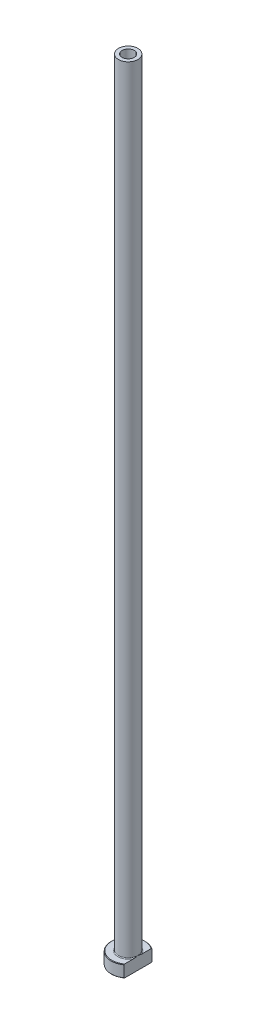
ISO-10303-21;
HEADER;
FILE_DESCRIPTION(('STEP AP214'),'2;1');
FILE_NAME('part.step','',(''),(''),'','','');
FILE_SCHEMA(('AUTOMOTIVE_DESIGN { 1 0 10303 214 1 1 1 1 }'));
ENDSEC;
DATA;
#1=APPLICATION_CONTEXT('core data for automotive mechanical design processes');
#2=APPLICATION_PROTOCOL_DEFINITION('international standard','automotive_design',2000,#1);
#3=PRODUCT_CONTEXT('',#1,'mechanical');
#4=PRODUCT('Part','Part','',(#3));
#5=PRODUCT_RELATED_PRODUCT_CATEGORY('part','',(#4));
#6=PRODUCT_DEFINITION_FORMATION('','',#4);
#7=PRODUCT_DEFINITION_CONTEXT('part definition',#1,'design');
#8=PRODUCT_DEFINITION('design','',#6,#7);
#9=PRODUCT_DEFINITION_SHAPE('','',#8);
#10=(LENGTH_UNIT() NAMED_UNIT(*) SI_UNIT(.MILLI.,.METRE.));
#11=(NAMED_UNIT(*) PLANE_ANGLE_UNIT() SI_UNIT($,.RADIAN.));
#12=(NAMED_UNIT(*) SI_UNIT($,.STERADIAN.) SOLID_ANGLE_UNIT());
#13=UNCERTAINTY_MEASURE_WITH_UNIT(LENGTH_MEASURE(1.E-05),#10,'distance_accuracy_value','');
#14=(GEOMETRIC_REPRESENTATION_CONTEXT(3) GLOBAL_UNCERTAINTY_ASSIGNED_CONTEXT((#13)) GLOBAL_UNIT_ASSIGNED_CONTEXT((#10,
#11,#12)) REPRESENTATION_CONTEXT('',''));
#15=CARTESIAN_POINT('',(0.,0.,0.));
#16=DIRECTION('',(0.,0.,1.));
#17=DIRECTION('',(1.,0.,0.));
#18=AXIS2_PLACEMENT_3D('',#15,#16,#17);
#19=CARTESIAN_POINT('',(0.,92.1876809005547,0.));
#20=DIRECTION('',(0.,1.,0.));
#21=DIRECTION('',(0.,0.,1.));
#22=AXIS2_PLACEMENT_3D('',#19,#20,#21);
#23=CYLINDRICAL_SURFACE('',#22,2.50000000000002);
#24=CARTESIAN_POINT('',(0.,325.,0.));
#25=DIRECTION('',(0.,1.,0.));
#26=DIRECTION('',(0.,0.,1.));
#27=AXIS2_PLACEMENT_3D('',#24,#25,#26);
#28=CIRCLE('',#27,2.50000000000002);
#29=CARTESIAN_POINT('',(0.,325.,2.50000000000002));
#30=VERTEX_POINT('',#29);
#31=EDGE_CURVE('E167',#30,#30,#28,.T.);
#32=ORIENTED_EDGE('',*,*,#31,.T.);
#33=EDGE_LOOP('',(#32));
#34=FACE_BOUND('',#33,.T.);
#35=CARTESIAN_POINT('',(0.,280.,0.));
#36=DIRECTION('',(0.,1.,0.));
#37=DIRECTION('',(0.,0.,1.));
#38=AXIS2_PLACEMENT_3D('',#35,#36,#37);
#39=CIRCLE('',#38,2.50000000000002);
#40=CARTESIAN_POINT('',(0.,280.,2.50000000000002));
#41=VERTEX_POINT('',#40);
#42=EDGE_CURVE('E170',#41,#41,#39,.T.);
#43=ORIENTED_EDGE('',*,*,#42,.F.);
#44=EDGE_LOOP('',(#43));
#45=FACE_BOUND('',#44,.T.);
#46=ADVANCED_FACE('F32',(#34,#45),#23,.F.);
#47=CARTESIAN_POINT('',(-2.50000000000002,325.,0.));
#48=DIRECTION('',(0.,1.,0.));
#49=DIRECTION('',(0.,0.,1.));
#50=AXIS2_PLACEMENT_3D('',#47,#48,#49);
#51=PLANE('',#50);
#52=CARTESIAN_POINT('',(0.,325.,0.));
#53=DIRECTION('',(0.,1.,0.));
#54=DIRECTION('',(0.,0.,1.));
#55=AXIS2_PLACEMENT_3D('',#52,#53,#54);
#56=CIRCLE('',#55,4.00000000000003);
#57=CARTESIAN_POINT('',(0.,325.,4.00000000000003));
#58=VERTEX_POINT('',#57);
#59=EDGE_CURVE('E174',#58,#58,#56,.T.);
#60=ORIENTED_EDGE('',*,*,#59,.T.);
#61=EDGE_LOOP('',(#60));
#62=FACE_BOUND('',#61,.T.);
#63=ORIENTED_EDGE('',*,*,#31,.F.);
#64=EDGE_LOOP('',(#63));
#65=FACE_BOUND('',#64,.T.);
#66=ADVANCED_FACE('F157',(#62,#65),#51,.T.);
#67=CARTESIAN_POINT('',(0.,92.1876809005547,0.));
#68=DIRECTION('',(0.,1.,0.));
#69=DIRECTION('',(0.,0.,1.));
#70=AXIS2_PLACEMENT_3D('',#67,#68,#69);
#71=CYLINDRICAL_SURFACE('',#70,4.00000000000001);
#72=CARTESIAN_POINT('',(0.,5.3,0.));
#73=DIRECTION('',(0.,1.,0.));
#74=DIRECTION('',(0.,0.,1.));
#75=AXIS2_PLACEMENT_3D('',#72,#73,#74);
#76=CIRCLE('',#75,4.00000000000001);
#77=CARTESIAN_POINT('',(4.,5.3,0.));
#78=VERTEX_POINT('',#77);
#79=EDGE_CURVE('E180',#78,#78,#76,.T.);
#80=ORIENTED_EDGE('',*,*,#79,.T.);
#81=EDGE_LOOP('',(#80));
#82=FACE_BOUND('',#81,.T.);
#83=ORIENTED_EDGE('',*,*,#59,.F.);
#84=EDGE_LOOP('',(#83));
#85=FACE_BOUND('',#84,.T.);
#86=ADVANCED_FACE('F162',(#82,#85),#71,.T.);
#87=CARTESIAN_POINT('',(-3.99999999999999,5.,0.));
#88=DIRECTION('',(0.,1.,0.));
#89=DIRECTION('',(0.,0.,1.));
#90=AXIS2_PLACEMENT_3D('',#87,#88,#89);
#91=PLANE('',#90);
#92=DIRECTION('',(0.,0.,1.));
#93=VECTOR('',#92,1.);
#94=CARTESIAN_POINT('',(4.,5.,0.));
#95=LINE('',#94,#93);
#96=CARTESIAN_POINT('',(4.,5.,-5.49909083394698));
#97=VERTEX_POINT('',#96);
#98=CARTESIAN_POINT('',(4.,5.,-1.57797338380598));
#99=VERTEX_POINT('',#98);
#100=EDGE_CURVE('E54',#97,#99,#95,.T.);
#101=ORIENTED_EDGE('',*,*,#100,.F.);
#102=CARTESIAN_POINT('',(0.,5.,0.));
#103=DIRECTION('',(0.,1.,0.));
#104=DIRECTION('',(0.,0.,1.));
#105=AXIS2_PLACEMENT_3D('',#102,#103,#104);
#106=CIRCLE('',#105,6.79999999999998);
#107=CARTESIAN_POINT('',(3.99999999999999,5.,5.49909083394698));
#108=VERTEX_POINT('',#107);
#109=EDGE_CURVE('E186',#97,#108,#106,.T.);
#110=ORIENTED_EDGE('',*,*,#109,.T.);
#111=CARTESIAN_POINT('',(4.,5.,1.57797338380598));
#112=VERTEX_POINT('',#111);
#113=EDGE_CURVE('E134',#112,#108,#95,.T.);
#114=ORIENTED_EDGE('',*,*,#113,.F.);
#115=CARTESIAN_POINT('',(0.,5.,0.));
#116=DIRECTION('',(0.,1.,0.));
#117=DIRECTION('',(0.,0.,1.));
#118=AXIS2_PLACEMENT_3D('',#115,#116,#117);
#119=CIRCLE('',#118,4.30000000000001);
#120=EDGE_CURVE('E183',#112,#99,#119,.F.);
#121=ORIENTED_EDGE('',*,*,#120,.T.);
#122=EDGE_LOOP('',(#101,#110,#114,#121));
#123=FACE_BOUND('',#122,.T.);
#124=ADVANCED_FACE('F197',(#123),#91,.T.);
#125=CARTESIAN_POINT('',(0.,92.1876809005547,0.));
#126=DIRECTION('',(0.,1.,0.));
#127=DIRECTION('',(0.,0.,1.));
#128=AXIS2_PLACEMENT_3D('',#125,#126,#127);
#129=CYLINDRICAL_SURFACE('',#128,6.99999999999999);
#130=DIRECTION('',(0.,-1.,0.));
#131=VECTOR('',#130,1.);
#132=CARTESIAN_POINT('',(3.99999999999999,325.,5.74456264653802));
#133=LINE('',#132,#131);
#134=CARTESIAN_POINT('',(3.99999999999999,4.8,5.74456264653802));
#135=VERTEX_POINT('',#134);
#136=CARTESIAN_POINT('',(3.99999999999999,0.200000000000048,5.74456264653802));
#137=VERTEX_POINT('',#136);
#138=EDGE_CURVE('E82',#135,#137,#133,.T.);
#139=ORIENTED_EDGE('',*,*,#138,.F.);
#140=CARTESIAN_POINT('',(0.,4.8,0.));
#141=DIRECTION('',(0.,1.,0.));
#142=DIRECTION('',(0.,0.,1.));
#143=AXIS2_PLACEMENT_3D('',#140,#141,#142);
#144=CIRCLE('',#143,6.99999999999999);
#145=CARTESIAN_POINT('',(4.,4.8,-5.74456264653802));
#146=VERTEX_POINT('',#145);
#147=EDGE_CURVE('E95',#135,#146,#144,.F.);
#148=ORIENTED_EDGE('',*,*,#147,.T.);
#149=DIRECTION('',(0.,-1.,0.));
#150=VECTOR('',#149,1.);
#151=CARTESIAN_POINT('',(4.,325.,-5.74456264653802));
#152=LINE('',#151,#150);
#153=CARTESIAN_POINT('',(4.,0.200000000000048,-5.74456264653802));
#154=VERTEX_POINT('',#153);
#155=EDGE_CURVE('E192',#146,#154,#152,.T.);
#156=ORIENTED_EDGE('',*,*,#155,.T.);
#157=CARTESIAN_POINT('',(0.,0.200000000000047,0.));
#158=DIRECTION('',(0.,-1.,0.));
#159=DIRECTION('',(0.,0.,-1.));
#160=AXIS2_PLACEMENT_3D('',#157,#158,#159);
#161=CIRCLE('',#160,6.99999999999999);
#162=EDGE_CURVE('E98',#154,#137,#161,.F.);
#163=ORIENTED_EDGE('',*,*,#162,.T.);
#164=EDGE_LOOP('',(#139,#148,#156,#163));
#165=FACE_BOUND('',#164,.T.);
#166=ADVANCED_FACE('F190',(#165),#129,.T.);
#167=CARTESIAN_POINT('',(-6.99999999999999,0.,0.));
#168=DIRECTION('',(0.,-1.,0.));
#169=DIRECTION('',(0.,0.,-1.));
#170=AXIS2_PLACEMENT_3D('',#167,#168,#169);
#171=PLANE('',#170);
#172=CARTESIAN_POINT('',(0.,0.,0.));
#173=DIRECTION('',(0.,-1.,0.));
#174=DIRECTION('',(0.,0.,-1.));
#175=AXIS2_PLACEMENT_3D('',#172,#173,#174);
#176=CIRCLE('',#175,3.25000000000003);
#177=CARTESIAN_POINT('',(0.,0.,-3.25000000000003));
#178=VERTEX_POINT('',#177);
#179=EDGE_CURVE('E40',#178,#178,#176,.F.);
#180=ORIENTED_EDGE('',*,*,#179,.T.);
#181=EDGE_LOOP('',(#180));
#182=FACE_BOUND('',#181,.T.);
#183=DIRECTION('',(0.,0.,-1.));
#184=VECTOR('',#183,1.);
#185=CARTESIAN_POINT('',(3.99999999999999,0.,5.74456264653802));
#186=LINE('',#185,#184);
#187=CARTESIAN_POINT('',(3.99999999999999,0.,5.49909083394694));
#188=VERTEX_POINT('',#187);
#189=CARTESIAN_POINT('',(4.,0.,-5.49909083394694));
#190=VERTEX_POINT('',#189);
#191=EDGE_CURVE('E47',#188,#190,#186,.T.);
#192=ORIENTED_EDGE('',*,*,#191,.F.);
#193=CARTESIAN_POINT('',(0.,0.,0.));
#194=DIRECTION('',(0.,-1.,0.));
#195=DIRECTION('',(0.,0.,-1.));
#196=AXIS2_PLACEMENT_3D('',#193,#194,#195);
#197=CIRCLE('',#196,6.79999999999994);
#198=EDGE_CURVE('E92',#188,#190,#197,.T.);
#199=ORIENTED_EDGE('',*,*,#198,.T.);
#200=EDGE_LOOP('',(#192,#199));
#201=FACE_BOUND('',#200,.T.);
#202=ADVANCED_FACE('F91',(#182,#201),#171,.T.);
#203=CARTESIAN_POINT('',(0.,92.1876809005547,0.));
#204=DIRECTION('',(0.,1.,0.));
#205=DIRECTION('',(0.,0.,1.));
#206=AXIS2_PLACEMENT_3D('',#203,#204,#205);
#207=CYLINDRICAL_SURFACE('',#206,2.75000000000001);
#208=CARTESIAN_POINT('',(0.,0.500000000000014,0.));
#209=DIRECTION('',(0.,-1.,0.));
#210=DIRECTION('',(0.,0.,-1.));
#211=AXIS2_PLACEMENT_3D('',#208,#209,#210);
#212=CIRCLE('',#211,2.75000000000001);
#213=CARTESIAN_POINT('',(0.,0.500000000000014,-2.75000000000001));
#214=VERTEX_POINT('',#213);
#215=EDGE_CURVE('E11',#214,#214,#212,.T.);
#216=ORIENTED_EDGE('',*,*,#215,.T.);
#217=EDGE_LOOP('',(#216));
#218=FACE_BOUND('',#217,.T.);
#219=CARTESIAN_POINT('',(0.,268.,0.));
#220=DIRECTION('',(0.,1.,0.));
#221=DIRECTION('',(0.,0.,1.));
#222=AXIS2_PLACEMENT_3D('',#219,#220,#221);
#223=CIRCLE('',#222,2.75000000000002);
#224=CARTESIAN_POINT('',(0.,268.,2.75000000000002));
#225=VERTEX_POINT('',#224);
#226=EDGE_CURVE('E172',#225,#225,#223,.T.);
#227=ORIENTED_EDGE('',*,*,#226,.T.);
#228=EDGE_LOOP('',(#227));
#229=FACE_BOUND('',#228,.T.);
#230=ADVANCED_FACE('F215',(#218,#229),#207,.F.);
#231=CARTESIAN_POINT('',(0.,268.,0.));
#232=DIRECTION('',(0.,-1.,0.));
#233=DIRECTION('',(0.,0.,-1.));
#234=AXIS2_PLACEMENT_3D('',#231,#232,#233);
#235=CONICAL_SURFACE('',#234,2.75000000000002,0.0208303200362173);
#236=ORIENTED_EDGE('',*,*,#42,.T.);
#237=EDGE_LOOP('',(#236));
#238=FACE_BOUND('',#237,.T.);
#239=ORIENTED_EDGE('',*,*,#226,.F.);
#240=EDGE_LOOP('',(#239));
#241=FACE_BOUND('',#240,.T.);
#242=ADVANCED_FACE('F111',(#238,#241),#235,.F.);
#243=CARTESIAN_POINT('',(0.,5.3,0.));
#244=DIRECTION('',(0.,1.,0.));
#245=DIRECTION('',(0.,0.,1.));
#246=AXIS2_PLACEMENT_3D('',#243,#244,#245);
#247=TOROIDAL_SURFACE('',#246,4.30000000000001,0.3);
#248=ORIENTED_EDGE('',*,*,#120,.F.);
#249=CARTESIAN_POINT('',(4.,5.3,0.));
#250=CARTESIAN_POINT('',(4.,5.30000062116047,-1.06261453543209E-10));
#251=CARTESIAN_POINT('',(4.,5.30000124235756,2.1772621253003E-07));
#252=CARTESIAN_POINT('',(4.,5.30000240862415,8.36141322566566E-07));
#253=CARTESIAN_POINT('',(4.,5.30000294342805,1.25011718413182E-06));
#254=CARTESIAN_POINT('',(4.,5.30000404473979,2.23959391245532E-06));
#255=CARTESIAN_POINT('',(4.,5.30000459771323,2.83084527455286E-06));
#256=CARTESIAN_POINT('',(4.,5.30000559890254,4.0651667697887E-06));
#257=CARTESIAN_POINT('',(4.,5.30000604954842,4.70640153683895E-06));
#258=CARTESIAN_POINT('',(4.,5.30000769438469,7.15677325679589E-06));
#259=CARTESIAN_POINT('',(4.,5.30000879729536,9.02996126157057E-06));
#260=CARTESIAN_POINT('',(4.,5.30001063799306,1.27664904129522E-05));
#261=CARTESIAN_POINT('',(4.,5.3000113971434,1.46197821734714E-05));
#262=CARTESIAN_POINT('',(4.,5.30001453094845,2.23679248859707E-05));
#263=CARTESIAN_POINT('',(4.,5.30001683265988,2.82968786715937E-05));
#264=CARTESIAN_POINT('',(4.,5.30002027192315,3.95668773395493E-05));
#265=CARTESIAN_POINT('',(4.,5.30002152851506,4.48715500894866E-05));
#266=CARTESIAN_POINT('',(4.,5.30003060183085,8.4011826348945E-05));
#267=CARTESIAN_POINT('',(4.,5.30003739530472,0.000118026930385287));
#268=CARTESIAN_POINT('',(4.,5.30006713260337,0.000252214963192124));
#269=CARTESIAN_POINT('',(4.,5.30009559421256,0.000351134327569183));
#270=CARTESIAN_POINT('',(4.,5.30020622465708,0.000742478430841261));
#271=CARTESIAN_POINT('',(4.,5.30028475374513,0.00103561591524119));
#272=CARTESIAN_POINT('',(4.,5.30059889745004,0.00219920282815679));
#273=CARTESIAN_POINT('',(4.,5.30083905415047,0.00306873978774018));
#274=CARTESIAN_POINT('',(4.,5.30183682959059,0.00669141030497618));
#275=CARTESIAN_POINT('',(4.,5.3025887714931,0.00944568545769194));
#276=CARTESIAN_POINT('',(3.99999999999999,5.31066890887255,0.0390293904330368));
#277=CARTESIAN_POINT('',(4.,5.31802631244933,0.0658531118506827));
#278=CARTESIAN_POINT('',(4.,5.33239676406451,0.118441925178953));
#279=CARTESIAN_POINT('',(4.,5.33941183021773,0.144206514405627));
#280=CARTESIAN_POINT('',(4.,5.35427366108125,0.199017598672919));
#281=CARTESIAN_POINT('',(4.,5.3621131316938,0.228066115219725));
#282=CARTESIAN_POINT('',(4.,5.37776349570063,0.286511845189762));
#283=CARTESIAN_POINT('',(4.,5.38557313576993,0.31590939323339));
#284=CARTESIAN_POINT('',(4.,5.40425662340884,0.386994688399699));
#285=CARTESIAN_POINT('',(4.,5.41505237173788,0.428703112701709));
#286=CARTESIAN_POINT('',(4.,5.43592310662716,0.51109852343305));
#287=CARTESIAN_POINT('',(4.,5.44600969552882,0.551782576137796));
#288=CARTESIAN_POINT('',(4.,5.47850986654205,0.686599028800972));
#289=CARTESIAN_POINT('',(4.,5.49978370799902,0.781011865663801));
#290=CARTESIAN_POINT('',(4.,5.53807543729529,0.971847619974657));
#291=CARTESIAN_POINT('',(4.,5.55504273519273,1.06828120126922));
#292=CARTESIAN_POINT('',(4.,5.57582405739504,1.21752725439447));
#293=CARTESIAN_POINT('',(4.,5.58209796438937,1.26999379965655));
#294=CARTESIAN_POINT('',(4.,5.59210686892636,1.37516324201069));
#295=CARTESIAN_POINT('',(4.,5.59584265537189,1.42786606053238));
#296=CARTESIAN_POINT('',(4.,5.60010438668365,1.53310673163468));
#297=CARTESIAN_POINT('',(4.,5.6006487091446,1.58564378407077));
#298=CARTESIAN_POINT('',(4.,5.59767158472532,1.69058605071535));
#299=CARTESIAN_POINT('',(4.,5.59415502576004,1.74299134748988));
#300=CARTESIAN_POINT('',(4.,5.58503062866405,1.81903290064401));
#301=CARTESIAN_POINT('',(4.,5.58157617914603,1.84292934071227));
#302=CARTESIAN_POINT('',(4.,5.5732995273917,1.89051061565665));
#303=CARTESIAN_POINT('',(4.,5.56847619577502,1.91419525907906));
#304=CARTESIAN_POINT('',(4.,5.55726644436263,1.96092888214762));
#305=CARTESIAN_POINT('',(4.,5.55089740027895,1.98398195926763));
#306=CARTESIAN_POINT('',(4.,5.53623434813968,2.02945550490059));
#307=CARTESIAN_POINT('',(4.,5.52794253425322,2.05187666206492));
#308=CARTESIAN_POINT('',(4.,5.50887098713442,2.09590631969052));
#309=CARTESIAN_POINT('',(4.,5.49806837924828,2.11750508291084));
#310=CARTESIAN_POINT('',(4.,5.47333401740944,2.15885583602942));
#311=CARTESIAN_POINT('',(4.,5.45941272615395,2.1786136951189));
#312=CARTESIAN_POINT('',(4.,5.4358822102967,2.20522942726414));
#313=CARTESIAN_POINT('',(4.,5.42781139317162,2.21344043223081));
#314=CARTESIAN_POINT('',(4.,5.41065114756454,2.228751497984));
#315=CARTESIAN_POINT('',(4.,5.40156129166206,2.23585108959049));
#316=CARTESIAN_POINT('',(4.,5.38220524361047,2.24859694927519));
#317=CARTESIAN_POINT('',(4.,5.37192420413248,2.25422119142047));
#318=CARTESIAN_POINT('',(4.,5.35045072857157,2.26331064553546));
#319=CARTESIAN_POINT('',(4.,5.33926122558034,2.26678251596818));
#320=CARTESIAN_POINT('',(4.,5.31952044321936,2.27051268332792));
#321=CARTESIAN_POINT('',(4.,5.31108453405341,2.27139016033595));
#322=CARTESIAN_POINT('',(4.,5.29418624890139,2.27168963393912));
#323=CARTESIAN_POINT('',(4.,5.28572387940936,2.27111196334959));
#324=CARTESIAN_POINT('',(4.,5.26904138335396,2.26855580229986));
#325=CARTESIAN_POINT('',(4.,5.26082066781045,2.26658107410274));
#326=CARTESIAN_POINT('',(4.,5.24478214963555,2.26139496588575));
#327=CARTESIAN_POINT('',(4.,5.23696461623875,2.25818277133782));
#328=CARTESIAN_POINT('',(4.,5.21851235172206,2.24908332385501));
#329=CARTESIAN_POINT('',(4.,5.20815219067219,2.24264095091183));
#330=CARTESIAN_POINT('',(4.,5.18857975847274,2.22819957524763));
#331=CARTESIAN_POINT('',(4.,5.17937061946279,2.22019647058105));
#332=CARTESIAN_POINT('',(4.,5.15665383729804,2.19777756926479));
#333=CARTESIAN_POINT('',(4.,5.14403484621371,2.18246908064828));
#334=CARTESIAN_POINT('',(4.,5.12118369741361,2.15020843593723));
#335=CARTESIAN_POINT('',(4.,5.11095480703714,2.13325407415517));
#336=CARTESIAN_POINT('',(4.,5.09273574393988,2.09892324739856));
#337=CARTESIAN_POINT('',(4.,5.08468212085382,2.08157988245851));
#338=CARTESIAN_POINT('',(4.,5.07005901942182,2.04627072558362));
#339=CARTESIAN_POINT('',(4.,5.06349101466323,2.02830433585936));
#340=CARTESIAN_POINT('',(4.,5.04555485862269,1.97350761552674));
#341=CARTESIAN_POINT('',(4.,5.03608974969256,1.9360577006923));
#342=CARTESIAN_POINT('',(4.,5.01780569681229,1.84529235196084));
#343=CARTESIAN_POINT('',(4.,5.01077018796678,1.79164082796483));
#344=CARTESIAN_POINT('',(4.,5.00182846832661,1.68379947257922));
#345=CARTESIAN_POINT('',(4.,4.99993887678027,1.62960846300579));
#346=CARTESIAN_POINT('',(4.,5.00006129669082,1.52361204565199));
#347=CARTESIAN_POINT('',(4.,5.00190698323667,1.47180551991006));
#348=CARTESIAN_POINT('',(4.,5.00841243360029,1.36835357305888));
#349=CARTESIAN_POINT('',(4.,5.01307376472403,1.3167082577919));
#350=CARTESIAN_POINT('',(4.,5.02905484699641,1.17431887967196));
#351=CARTESIAN_POINT('',(4.,5.04274090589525,1.0838420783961));
#352=CARTESIAN_POINT('',(4.,5.06701714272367,0.947757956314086));
#353=CARTESIAN_POINT('',(4.,5.07585573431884,0.901814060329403));
#354=CARTESIAN_POINT('',(4.,5.09458665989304,0.810008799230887));
#355=CARTESIAN_POINT('',(4.,5.10448180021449,0.764148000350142));
#356=CARTESIAN_POINT('',(4.,5.12892434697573,0.655631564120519));
#357=CARTESIAN_POINT('',(4.,5.14383556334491,0.59305867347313));
#358=CARTESIAN_POINT('',(4.,5.1745876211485,0.46888522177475));
#359=CARTESIAN_POINT('',(4.,5.19041623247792,0.407281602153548));
#360=CARTESIAN_POINT('',(4.,5.22090834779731,0.291232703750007));
#361=CARTESIAN_POINT('',(4.,5.23550024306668,0.23676837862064));
#362=CARTESIAN_POINT('',(3.99999999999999,5.26562550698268,0.125604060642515));
#363=CARTESIAN_POINT('',(3.99999999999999,5.28117250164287,0.0689076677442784));
#364=CARTESIAN_POINT('',(4.,5.29741226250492,0.009441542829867));
#365=CARTESIAN_POINT('',(4.,5.29816540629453,0.00668315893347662));
#366=CARTESIAN_POINT('',(4.,5.29916346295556,0.00305954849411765));
#367=CARTESIAN_POINT('',(4.,5.29940273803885,0.0021931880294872));
#368=CARTESIAN_POINT('',(4.,5.29971580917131,0.00103357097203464));
#369=CARTESIAN_POINT('',(4.,5.29979412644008,0.000741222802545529));
#370=CARTESIAN_POINT('',(4.,5.29990450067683,0.000350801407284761));
#371=CARTESIAN_POINT('',(4.,5.29993292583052,0.000252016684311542));
#372=CARTESIAN_POINT('',(4.,5.29996263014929,0.000117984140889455));
#373=CARTESIAN_POINT('',(4.,5.2999694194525,8.39881955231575E-05));
#374=CARTESIAN_POINT('',(4.,5.29997848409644,4.48674050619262E-05));
#375=CARTESIAN_POINT('',(4.,5.29997973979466,3.95638228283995E-05));
#376=CARTESIAN_POINT('',(4.,5.29998317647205,2.82960370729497E-05));
#377=CARTESIAN_POINT('',(4.,5.29998547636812,2.23681479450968E-05));
#378=CARTESIAN_POINT('',(4.,5.29998860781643,1.4621101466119E-05));
#379=CARTESIAN_POINT('',(4.,5.29998936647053,1.27678914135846E-05));
#380=CARTESIAN_POINT('',(4.,5.29999120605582,9.0314417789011E-06));
#381=CARTESIAN_POINT('',(4.,5.29999230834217,7.15824184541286E-06));
#382=CARTESIAN_POINT('',(4.,5.29999395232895,4.70775581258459E-06));
#383=CARTESIAN_POINT('',(4.,5.29999440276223,4.06646447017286E-06));
#384=CARTESIAN_POINT('',(4.,5.29999540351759,2.83199145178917E-06));
#385=CARTESIAN_POINT('',(4.,5.29999595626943,2.24064391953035E-06));
#386=CARTESIAN_POINT('',(4.,5.29999705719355,1.25094007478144E-06));
#387=CARTESIAN_POINT('',(4.,5.29999759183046,8.36841376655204E-07));
#388=CARTESIAN_POINT('',(4.,5.29999875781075,2.18117893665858E-07));
#389=CARTESIAN_POINT('',(4.,5.29999937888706,1.06254530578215E-10));
#390=CARTESIAN_POINT('',(4.,5.3,0.));
#391=B_SPLINE_CURVE_WITH_KNOTS('',3,(#249,#250,#251,#252,#253,#254,#255,#256,#257,#258,#259,
#260,#261,#262,#263,#264,#265,#266,#267,#268,#269,#270,#271,#272,#273,#274,#275,#276,#277,#278,
#279,#280,#281,#282,#283,#284,#285,#286,#287,#288,#289,#290,#291,#292,#293,#294,#295,#296,#297,
#298,#299,#300,#301,#302,#303,#304,#305,#306,#307,#308,#309,#310,#311,#312,#313,#314,#315,#316,
#317,#318,#319,#320,#321,#322,#323,#324,#325,#326,#327,#328,#329,#330,#331,#332,#333,#334,#335,
#336,#337,#338,#339,#340,#341,#342,#343,#344,#345,#346,#347,#348,#349,#350,#351,#352,#353,#354,
#355,#356,#357,#358,#359,#360,#361,#362,#363,#364,#365,#366,#367,#368,#369,#370,#371,#372,#373,
#374,#375,#376,#377,#378,#379,#380,#381,#382,#383,#384,#385,#386,#387,#388,#389,#390),
.UNSPECIFIED.,.T.,.F.,(4,2,2,2,2,2,2,2,2,2,2,2,2,2,2,2,2,2,2,2,2,2,2,2,2,2,2,2,2,2,2,2,2,2,2,2,
2,2,2,2,2,2,2,2,2,2,2,2,2,2,2,2,2,2,2,2,2,2,2,2,2,2,2,2,2,2,2,2,2,2,4),(0.,1.87484253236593E-06,
3.90179733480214E-06,6.31683471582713E-06,8.66651513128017E-06,1.51627503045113E-05,
2.11657867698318E-05,4.02090715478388E-05,5.654293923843E-05,0.000160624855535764,
0.000469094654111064,0.00137985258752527,0.00408571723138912,0.0126514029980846,
0.096091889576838,0.176200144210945,0.266463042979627,0.357714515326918,0.486961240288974,
0.612707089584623,0.902988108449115,1.19653589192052,1.35501075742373,1.51343634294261,
1.67094875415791,1.82827177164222,1.9006759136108,1.97313996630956,2.04482437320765,
2.11642737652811,2.18871023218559,2.26075412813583,2.29521947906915,2.32969934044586,
2.36466792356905,2.3995277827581,2.42485422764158,2.45017488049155,2.47542760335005,
2.50069697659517,2.53708899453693,2.57357798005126,2.63276032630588,2.6920231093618,
2.74930315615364,2.80663977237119,2.92223125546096,3.08420752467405,3.24670629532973,
3.4021285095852,3.5576373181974,3.83192962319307,3.97228382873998,4.11302057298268,
4.30598130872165,4.49678885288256,4.66594443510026,4.84230602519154,4.85088453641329,
4.85358051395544,4.85448881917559,4.85479687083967,4.85490089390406,4.85491722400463,
4.85493626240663,4.85494226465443,4.85494875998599,4.85495110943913,4.85495352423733,
4.85495555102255,4.85495742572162),.UNSPECIFIED.);
#392=EDGE_CURVE('E126',#112,#78,#391,.T.);
#393=ORIENTED_EDGE('',*,*,#392,.T.);
#394=ORIENTED_EDGE('',*,*,#79,.F.);
#395=CARTESIAN_POINT('',(4.,5.3,0.));
#396=CARTESIAN_POINT('',(4.,5.29999937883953,1.06262633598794E-10));
#397=CARTESIAN_POINT('',(4.,5.29999875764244,-2.17726211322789E-07));
#398=CARTESIAN_POINT('',(4.,5.29999759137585,-8.36141321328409E-07));
#399=CARTESIAN_POINT('',(4.,5.29999705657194,-1.25011718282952E-06));
#400=CARTESIAN_POINT('',(4.,5.29999595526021,-2.23959391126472E-06));
#401=CARTESIAN_POINT('',(4.,5.29999540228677,-2.83084527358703E-06));
#402=CARTESIAN_POINT('',(4.,5.29999440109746,-4.06516676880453E-06));
#403=CARTESIAN_POINT('',(4.,5.29999395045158,-4.7064015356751E-06));
#404=CARTESIAN_POINT('',(4.,5.2999923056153,-7.15677325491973E-06));
#405=CARTESIAN_POINT('',(4.,5.29999120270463,-9.02996125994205E-06));
#406=CARTESIAN_POINT('',(4.,5.29998936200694,-1.27664904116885E-05));
#407=CARTESIAN_POINT('',(4.,5.2999886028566,-1.46197821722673E-05));
#408=CARTESIAN_POINT('',(4.,5.29998546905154,-2.2367924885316E-05));
#409=CARTESIAN_POINT('',(4.,5.29998316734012,-2.82968786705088E-05));
#410=CARTESIAN_POINT('',(4.,5.29997972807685,-3.95668773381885E-05));
#411=CARTESIAN_POINT('',(4.,5.29997847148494,-4.4871550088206E-05));
#412=CARTESIAN_POINT('',(4.,5.29996939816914,-8.40118263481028E-05));
#413=CARTESIAN_POINT('',(4.,5.29996260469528,-0.000118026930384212));
#414=CARTESIAN_POINT('',(4.,5.29993286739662,-0.00025221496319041));
#415=CARTESIAN_POINT('',(4.,5.29990440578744,-0.000351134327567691));
#416=CARTESIAN_POINT('',(4.,5.29979377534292,-0.000742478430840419));
#417=CARTESIAN_POINT('',(4.,5.29971524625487,-0.00103561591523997));
#418=CARTESIAN_POINT('',(4.,5.29940110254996,-0.00219920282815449));
#419=CARTESIAN_POINT('',(4.,5.29916094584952,-0.00306873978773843));
#420=CARTESIAN_POINT('',(4.,5.29816317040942,-0.00669141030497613));
#421=CARTESIAN_POINT('',(4.,5.2974112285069,-0.00944568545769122));
#422=CARTESIAN_POINT('',(3.99999999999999,5.28933109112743,-0.0390293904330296));
#423=CARTESIAN_POINT('',(4.,5.28197368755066,-0.0658531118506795));
#424=CARTESIAN_POINT('',(4.,5.26760323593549,-0.118441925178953));
#425=CARTESIAN_POINT('',(4.,5.26058816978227,-0.144206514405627));
#426=CARTESIAN_POINT('',(4.,5.24572633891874,-0.199017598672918));
#427=CARTESIAN_POINT('',(4.,5.2378868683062,-0.228066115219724));
#428=CARTESIAN_POINT('',(4.,5.22223650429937,-0.28651184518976));
#429=CARTESIAN_POINT('',(4.,5.21442686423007,-0.315909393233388));
#430=CARTESIAN_POINT('',(4.,5.19574337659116,-0.386994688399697));
#431=CARTESIAN_POINT('',(4.,5.18494762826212,-0.428703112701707));
#432=CARTESIAN_POINT('',(4.,5.16407689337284,-0.511098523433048));
#433=CARTESIAN_POINT('',(4.,5.15399030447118,-0.551782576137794));
#434=CARTESIAN_POINT('',(4.,5.12149013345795,-0.686599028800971));
#435=CARTESIAN_POINT('',(4.,5.10021629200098,-0.7810118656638));
#436=CARTESIAN_POINT('',(4.,5.06192456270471,-0.971847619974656));
#437=CARTESIAN_POINT('',(4.,5.04495726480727,-1.06828120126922));
#438=CARTESIAN_POINT('',(4.,5.02417594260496,-1.21752725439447));
#439=CARTESIAN_POINT('',(4.,5.01790203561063,-1.26999379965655));
#440=CARTESIAN_POINT('',(4.,5.00789313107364,-1.37516324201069));
#441=CARTESIAN_POINT('',(4.,5.00415734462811,-1.42786606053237));
#442=CARTESIAN_POINT('',(4.,4.99989561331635,-1.53310673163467));
#443=CARTESIAN_POINT('',(4.,4.9993512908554,-1.58564378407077));
#444=CARTESIAN_POINT('',(4.,5.00232841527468,-1.69058605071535));
#445=CARTESIAN_POINT('',(4.,5.00584497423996,-1.74299134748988));
#446=CARTESIAN_POINT('',(4.,5.01496937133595,-1.81903290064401));
#447=CARTESIAN_POINT('',(4.,5.01842382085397,-1.84292934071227));
#448=CARTESIAN_POINT('',(4.,5.0267004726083,-1.89051061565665));
#449=CARTESIAN_POINT('',(4.,5.03152380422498,-1.91419525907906));
#450=CARTESIAN_POINT('',(4.,5.04273355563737,-1.96092888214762));
#451=CARTESIAN_POINT('',(4.,5.04910259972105,-1.98398195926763));
#452=CARTESIAN_POINT('',(4.,5.06376565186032,-2.02945550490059));
#453=CARTESIAN_POINT('',(4.,5.07205746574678,-2.05187666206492));
#454=CARTESIAN_POINT('',(4.,5.09112901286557,-2.09590631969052));
#455=CARTESIAN_POINT('',(4.,5.10193162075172,-2.11750508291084));
#456=CARTESIAN_POINT('',(4.,5.12666598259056,-2.15885583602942));
#457=CARTESIAN_POINT('',(4.,5.14058727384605,-2.1786136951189));
#458=CARTESIAN_POINT('',(4.,5.1641177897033,-2.20522942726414));
#459=CARTESIAN_POINT('',(4.,5.17218860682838,-2.21344043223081));
#460=CARTESIAN_POINT('',(4.,5.18934885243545,-2.228751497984));
#461=CARTESIAN_POINT('',(4.,5.19843870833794,-2.23585108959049));
#462=CARTESIAN_POINT('',(4.,5.21779475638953,-2.24859694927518));
#463=CARTESIAN_POINT('',(4.,5.22807579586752,-2.25422119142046));
#464=CARTESIAN_POINT('',(4.,5.24954927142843,-2.26331064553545));
#465=CARTESIAN_POINT('',(4.,5.26073877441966,-2.26678251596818));
#466=CARTESIAN_POINT('',(4.,5.28047955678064,-2.27051268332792));
#467=CARTESIAN_POINT('',(4.,5.28891546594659,-2.27139016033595));
#468=CARTESIAN_POINT('',(4.,5.30581375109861,-2.27168963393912));
#469=CARTESIAN_POINT('',(4.,5.31427612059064,-2.27111196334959));
#470=CARTESIAN_POINT('',(4.,5.33095861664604,-2.26855580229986));
#471=CARTESIAN_POINT('',(4.,5.33917933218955,-2.26658107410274));
#472=CARTESIAN_POINT('',(4.,5.35521785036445,-2.26139496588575));
#473=CARTESIAN_POINT('',(4.,5.36303538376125,-2.25818277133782));
#474=CARTESIAN_POINT('',(4.,5.38148764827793,-2.24908332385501));
#475=CARTESIAN_POINT('',(4.,5.3918478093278,-2.24264095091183));
#476=CARTESIAN_POINT('',(4.,5.41142024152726,-2.22819957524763));
#477=CARTESIAN_POINT('',(4.,5.42062938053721,-2.22019647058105));
#478=CARTESIAN_POINT('',(4.,5.44334616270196,-2.19777756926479));
#479=CARTESIAN_POINT('',(4.,5.45596515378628,-2.18246908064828));
#480=CARTESIAN_POINT('',(4.,5.47881630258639,-2.15020843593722));
#481=CARTESIAN_POINT('',(4.,5.48904519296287,-2.13325407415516));
#482=CARTESIAN_POINT('',(4.,5.50726425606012,-2.09892324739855));
#483=CARTESIAN_POINT('',(4.,5.51531787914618,-2.08157988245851));
#484=CARTESIAN_POINT('',(4.,5.52994098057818,-2.04627072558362));
#485=CARTESIAN_POINT('',(4.,5.53650898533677,-2.02830433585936));
#486=CARTESIAN_POINT('',(4.,5.55444514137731,-1.97350761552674));
#487=CARTESIAN_POINT('',(4.,5.56391025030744,-1.93605770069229));
#488=CARTESIAN_POINT('',(4.,5.58219430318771,-1.84529235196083));
#489=CARTESIAN_POINT('',(4.,5.58922981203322,-1.79164082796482));
#490=CARTESIAN_POINT('',(4.,5.59817153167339,-1.6837994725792));
#491=CARTESIAN_POINT('',(4.,5.60006112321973,-1.62960846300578));
#492=CARTESIAN_POINT('',(4.,5.59993870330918,-1.52361204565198));
#493=CARTESIAN_POINT('',(4.,5.59809301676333,-1.47180551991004));
#494=CARTESIAN_POINT('',(4.,5.5915875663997,-1.36835357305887));
#495=CARTESIAN_POINT('',(4.,5.58692623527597,-1.31670825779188));
#496=CARTESIAN_POINT('',(4.,5.57094515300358,-1.17431887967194));
#497=CARTESIAN_POINT('',(4.,5.55725909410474,-1.08384207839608));
#498=CARTESIAN_POINT('',(4.,5.53298285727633,-0.947757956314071));
#499=CARTESIAN_POINT('',(4.,5.52414426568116,-0.90181406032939));
#500=CARTESIAN_POINT('',(4.,5.50541334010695,-0.810008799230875));
#501=CARTESIAN_POINT('',(4.,5.49551819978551,-0.764148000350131));
#502=CARTESIAN_POINT('',(4.,5.47107565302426,-0.65563156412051));
#503=CARTESIAN_POINT('',(4.,5.45616443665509,-0.593058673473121));
#504=CARTESIAN_POINT('',(4.,5.4254123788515,-0.468885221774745));
#505=CARTESIAN_POINT('',(4.,5.40958376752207,-0.407281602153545));
#506=CARTESIAN_POINT('',(4.,5.3790916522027,-0.291232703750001));
#507=CARTESIAN_POINT('',(4.,5.36449975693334,-0.23676837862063));
#508=CARTESIAN_POINT('',(3.99999999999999,5.33437449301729,-0.125604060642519));
#509=CARTESIAN_POINT('',(3.99999999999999,5.31882749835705,-0.0689076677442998));
#510=CARTESIAN_POINT('',(4.,5.30258773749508,-0.00944154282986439));
#511=CARTESIAN_POINT('',(4.,5.30183459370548,-0.00668315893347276));
#512=CARTESIAN_POINT('',(4.,5.30083653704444,-0.00305954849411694));
#513=CARTESIAN_POINT('',(4.,5.30059726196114,-0.00219318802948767));
#514=CARTESIAN_POINT('',(4.,5.3002841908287,-0.00103357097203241));
#515=CARTESIAN_POINT('',(4.,5.30020587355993,-0.000741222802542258));
#516=CARTESIAN_POINT('',(4.,5.30009549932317,-0.000350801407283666));
#517=CARTESIAN_POINT('',(4.,5.30006707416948,-0.000252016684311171));
#518=CARTESIAN_POINT('',(4.,5.30003736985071,-0.000117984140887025));
#519=CARTESIAN_POINT('',(4.,5.30003058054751,-8.39881955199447E-05));
#520=CARTESIAN_POINT('',(4.,5.30002151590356,-4.48674050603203E-05));
#521=CARTESIAN_POINT('',(4.,5.30002026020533,-3.95638228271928E-05));
#522=CARTESIAN_POINT('',(4.,5.30001682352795,-2.82960370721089E-05));
#523=CARTESIAN_POINT('',(4.,5.30001452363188,-2.23681479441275E-05));
#524=CARTESIAN_POINT('',(4.,5.30001139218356,-1.46211014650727E-05));
#525=CARTESIAN_POINT('',(4.,5.30001063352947,-1.27678914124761E-05));
#526=CARTESIAN_POINT('',(4.,5.30000879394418,-9.03144177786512E-06));
#527=CARTESIAN_POINT('',(4.,5.30000769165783,-7.15824184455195E-06));
#528=CARTESIAN_POINT('',(4.,5.30000604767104,-4.70775581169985E-06));
#529=CARTESIAN_POINT('',(4.,5.30000559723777,-4.06646446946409E-06));
#530=CARTESIAN_POINT('',(4.,5.30000459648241,-2.83199145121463E-06));
#531=CARTESIAN_POINT('',(4.,5.30000404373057,-2.24064391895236E-06));
#532=CARTESIAN_POINT('',(4.,5.30000294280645,-1.25094007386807E-06));
#533=CARTESIAN_POINT('',(4.,5.30000240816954,-8.36841375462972E-07));
#534=CARTESIAN_POINT('',(4.,5.30000124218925,-2.1811789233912E-07));
#535=CARTESIAN_POINT('',(4.,5.30000062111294,-1.06253294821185E-10));
#536=CARTESIAN_POINT('',(4.,5.3,0.));
#537=B_SPLINE_CURVE_WITH_KNOTS('',3,(#395,#396,#397,#398,#399,#400,#401,#402,#403,#404,#405,
#406,#407,#408,#409,#410,#411,#412,#413,#414,#415,#416,#417,#418,#419,#420,#421,#422,#423,#424,
#425,#426,#427,#428,#429,#430,#431,#432,#433,#434,#435,#436,#437,#438,#439,#440,#441,#442,#443,
#444,#445,#446,#447,#448,#449,#450,#451,#452,#453,#454,#455,#456,#457,#458,#459,#460,#461,#462,
#463,#464,#465,#466,#467,#468,#469,#470,#471,#472,#473,#474,#475,#476,#477,#478,#479,#480,#481,
#482,#483,#484,#485,#486,#487,#488,#489,#490,#491,#492,#493,#494,#495,#496,#497,#498,#499,#500,
#501,#502,#503,#504,#505,#506,#507,#508,#509,#510,#511,#512,#513,#514,#515,#516,#517,#518,#519,
#520,#521,#522,#523,#524,#525,#526,#527,#528,#529,#530,#531,#532,#533,#534,#535,#536),
.UNSPECIFIED.,.T.,.F.,(4,2,2,2,2,2,2,2,2,2,2,2,2,2,2,2,2,2,2,2,2,2,2,2,2,2,2,2,2,2,2,2,2,2,2,2,
2,2,2,2,2,2,2,2,2,2,2,2,2,2,2,2,2,2,2,2,2,2,2,2,2,2,2,2,2,2,2,2,2,2,4),(0.,1.87484253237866E-06,
3.90179733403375E-06,6.31683471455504E-06,8.66651513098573E-06,1.51627503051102E-05,
2.11657867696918E-05,4.02090715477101E-05,5.65429392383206E-05,0.000160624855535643,
0.000469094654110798,0.00137985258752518,0.00408571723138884,0.0126514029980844,
0.0960918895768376,0.176200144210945,0.266463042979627,0.357714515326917,0.486961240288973,
0.612707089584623,0.902988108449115,1.19653589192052,1.35501075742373,1.5134363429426,
1.67094875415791,1.82827177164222,1.9006759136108,1.97313996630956,2.04482437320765,
2.11642737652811,2.18871023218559,2.26075412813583,2.29521947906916,2.32969934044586,
2.36466792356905,2.3995277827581,2.42485422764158,2.45017488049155,2.47542760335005,
2.50069697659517,2.53708899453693,2.57357798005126,2.63276032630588,2.69202310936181,
2.74930315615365,2.80663977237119,2.92223125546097,3.08420752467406,3.24670629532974,
3.40212850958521,3.55763731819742,3.83192962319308,3.97228382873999,4.11302057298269,
4.30598130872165,4.49678885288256,4.66594443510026,4.84230602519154,4.85088453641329,
4.85358051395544,4.85448881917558,4.85479687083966,4.85490089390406,4.85491722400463,
4.85493626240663,4.85494226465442,4.85494875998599,4.85495110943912,4.85495352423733,
4.85495555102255,4.85495742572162),.UNSPECIFIED.);
#538=EDGE_CURVE('E135',#78,#99,#537,.T.);
#539=ORIENTED_EDGE('',*,*,#538,.T.);
#540=EDGE_LOOP('',(#248,#393,#394,#539));
#541=FACE_BOUND('',#540,.T.);
#542=ADVANCED_FACE('F141',(#541),#247,.F.);
#543=CARTESIAN_POINT('',(0.,5.,0.));
#544=DIRECTION('',(0.,-1.,0.));
#545=DIRECTION('',(0.,0.,-1.));
#546=AXIS2_PLACEMENT_3D('',#543,#544,#545);
#547=CONICAL_SURFACE('',#546,6.79999999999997,0.785398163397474);
#548=CARTESIAN_POINT('',(4.,-1.45712845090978,-12.6392822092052));
#549=CARTESIAN_POINT('',(4.,-1.24364466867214,-12.4153556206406));
#550=CARTESIAN_POINT('',(4.,-1.03042430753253,-12.1911774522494));
#551=CARTESIAN_POINT('',(4.,-0.604617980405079,-11.7422167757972));
#552=CARTESIAN_POINT('',(4.,-0.392032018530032,-11.5174342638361));
#553=CARTESIAN_POINT('',(4.,0.0324624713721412,-11.0670952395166));
#554=CARTESIAN_POINT('',(4.,0.244370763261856,-10.8415385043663));
#555=CARTESIAN_POINT('',(4.,0.667290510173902,-10.3895875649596));
#556=CARTESIAN_POINT('',(4.,0.878301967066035,-10.1631933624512));
#557=CARTESIAN_POINT('',(4.,1.5138537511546,-9.47810122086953));
#558=CARTESIAN_POINT('',(4.,1.93676291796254,-9.01788214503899));
#559=CARTESIAN_POINT('',(4.,2.56612335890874,-8.32309905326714));
#560=CARTESIAN_POINT('',(4.,2.77505666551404,-8.0907845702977));
#561=CARTESIAN_POINT('',(4.,3.19080254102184,-7.62426940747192));
#562=CARTESIAN_POINT('',(4.,3.39761512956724,-7.39006874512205));
#563=CARTESIAN_POINT('',(4.,3.87870763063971,-6.838918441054));
#564=CARTESIAN_POINT('',(4.,4.15190978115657,-6.52102188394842));
#565=CARTESIAN_POINT('',(4.,4.55642425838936,-6.03960901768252));
#566=CARTESIAN_POINT('',(4.,4.69041050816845,-5.87833992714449));
#567=CARTESIAN_POINT('',(4.,4.95616531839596,-5.5539846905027));
#568=CARTESIAN_POINT('',(4.,5.08793391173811,-5.39089857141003));
#569=CARTESIAN_POINT('',(4.,5.34841712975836,-5.06288801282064));
#570=CARTESIAN_POINT('',(4.,5.47713786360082,-4.89796843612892));
#571=CARTESIAN_POINT('',(4.,5.73107494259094,-4.56545535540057));
#572=CARTESIAN_POINT('',(4.,5.85629144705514,-4.39786197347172));
#573=CARTESIAN_POINT('',(4.,6.10211465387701,-4.05948444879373));
#574=CARTESIAN_POINT('',(4.,6.22272435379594,-3.8887024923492));
#575=CARTESIAN_POINT('',(4.,6.45796076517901,-3.54308312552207));
#576=CARTESIAN_POINT('',(4.,6.57258867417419,-3.36824653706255));
#577=CARTESIAN_POINT('',(4.,6.76866603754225,-3.05381396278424));
#578=CARTESIAN_POINT('',(4.,6.85173773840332,-2.91523359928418));
#579=CARTESIAN_POINT('',(4.,7.01174537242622,-2.63451965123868));
#580=CARTESIAN_POINT('',(4.,7.0886804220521,-2.49238555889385));
#581=CARTESIAN_POINT('',(4.,7.2345943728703,-2.20416961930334));
#582=CARTESIAN_POINT('',(4.,7.30357836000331,-2.05809037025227));
#583=CARTESIAN_POINT('',(4.,7.43135520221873,-1.76151732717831));
#584=CARTESIAN_POINT('',(4.,7.49015114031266,-1.61102488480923));
#585=CARTESIAN_POINT('',(4.,7.58249315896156,-1.34142099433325));
#586=CARTESIAN_POINT('',(4.,7.61872660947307,-1.22323501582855));
#587=CARTESIAN_POINT('',(4.,7.68223354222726,-0.98449286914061));
#588=CARTESIAN_POINT('',(4.,7.70951040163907,-0.863937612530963));
#589=CARTESIAN_POINT('',(4.,7.75377914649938,-0.621342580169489));
#590=CARTESIAN_POINT('',(4.,7.77080509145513,-0.499309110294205));
#591=CARTESIAN_POINT('',(4.,7.79378778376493,-0.254194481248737));
#592=CARTESIAN_POINT('',(4.,7.79974523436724,-0.131113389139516));
#593=CARTESIAN_POINT('',(4.,7.80023957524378,0.115517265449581));
#594=CARTESIAN_POINT('',(4.,7.79473514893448,0.239066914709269));
#595=CARTESIAN_POINT('',(4.,7.77255119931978,0.485148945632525));
#596=CARTESIAN_POINT('',(4.,7.75587091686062,0.607681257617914));
#597=CARTESIAN_POINT('',(4.,7.71218353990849,0.851269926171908));
#598=CARTESIAN_POINT('',(4.,7.68514362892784,0.972320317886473));
#599=CARTESIAN_POINT('',(4.,7.6220120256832,1.21200276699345));
#600=CARTESIAN_POINT('',(4.,7.58591962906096,1.33063463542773));
#601=CARTESIAN_POINT('',(4.,7.4598007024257,1.70122439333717));
#602=CARTESIAN_POINT('',(4.,7.35572950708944,1.94843335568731));
#603=CARTESIAN_POINT('',(4.,7.18186715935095,2.31048534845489));
#604=CARTESIAN_POINT('',(4.,7.12087684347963,2.42983561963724));
#605=CARTESIAN_POINT('',(4.,6.99403531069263,2.66593629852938));
#606=CARTESIAN_POINT('',(3.99999999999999,6.92818466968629,2.78268701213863));
#607=CARTESIAN_POINT('',(3.99999999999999,6.79157875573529,3.01550895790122));
#608=CARTESIAN_POINT('',(3.99999999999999,6.72076681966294,3.13154660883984));
#609=CARTESIAN_POINT('',(3.99999999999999,6.57583116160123,3.36153379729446));
#610=CARTESIAN_POINT('',(3.99999999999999,6.50170736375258,3.47548328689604));
#611=CARTESIAN_POINT('',(3.99999999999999,6.35080982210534,3.70145107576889));
#612=CARTESIAN_POINT('',(3.99999999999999,6.27403866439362,3.81347110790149));
#613=CARTESIAN_POINT('',(3.99999999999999,6.11824120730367,4.03592316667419));
#614=CARTESIAN_POINT('',(3.99999999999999,6.03921496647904,4.14635523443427));
#615=CARTESIAN_POINT('',(3.99999999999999,5.81506547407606,4.45397159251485));
#616=CARTESIAN_POINT('',(3.99999999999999,5.66782256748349,4.64961120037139));
#617=CARTESIAN_POINT('',(3.99999999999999,5.36880597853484,5.03740600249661));
#618=CARTESIAN_POINT('',(3.99999999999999,5.21703183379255,5.22956083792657));
#619=CARTESIAN_POINT('',(3.99999999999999,4.90999105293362,5.61115465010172));
#620=CARTESIAN_POINT('',(3.99999999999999,4.75472331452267,5.80059273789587));
#621=CARTESIAN_POINT('',(3.99999999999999,4.4415075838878,6.17724364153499));
#622=CARTESIAN_POINT('',(3.99999999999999,4.28355951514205,6.36445639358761));
#623=CARTESIAN_POINT('',(3.99999999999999,3.9652580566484,6.73740614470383));
#624=CARTESIAN_POINT('',(3.99999999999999,3.80490084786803,6.92313987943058));
#625=CARTESIAN_POINT('',(3.99999999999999,3.48247055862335,7.29311320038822));
#626=CARTESIAN_POINT('',(3.99999999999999,3.32039746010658,7.47735277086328));
#627=CARTESIAN_POINT('',(3.99999999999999,2.83216188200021,8.02814826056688));
#628=CARTESIAN_POINT('',(3.99999999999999,2.50391696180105,8.39285790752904));
#629=CARTESIAN_POINT('',(3.99999999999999,1.87512078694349,9.08414492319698));
#630=CARTESIAN_POINT('',(3.99999999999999,1.57491666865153,9.41103929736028));
#631=CARTESIAN_POINT('',(3.99999999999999,0.972153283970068,10.0626830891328));
#632=CARTESIAN_POINT('',(3.99999999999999,0.669593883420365,10.3874323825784));
#633=CARTESIAN_POINT('',(3.99999999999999,0.0637759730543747,11.0341169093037));
#634=CARTESIAN_POINT('',(3.99999999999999,-0.239476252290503,11.3560580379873));
#635=CARTESIAN_POINT('',(3.99999999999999,-0.847356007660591,11.9985921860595));
#636=CARTESIAN_POINT('',(3.99999999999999,-1.15198342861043,12.3191853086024));
#637=CARTESIAN_POINT('',(3.99999999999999,-1.45712845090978,12.6392822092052));
#638=B_SPLINE_CURVE_WITH_KNOTS('',3,(#548,#549,#550,#551,#552,#553,#554,#555,#556,#557,#558,
#559,#560,#561,#562,#563,#564,#565,#566,#567,#568,#569,#570,#571,#572,#573,#574,#575,#576,#577,
#578,#579,#580,#581,#582,#583,#584,#585,#586,#587,#588,#589,#590,#591,#592,#593,#594,#595,#596,
#597,#598,#599,#600,#601,#602,#603,#604,#605,#606,#607,#608,#609,#610,#611,#612,#613,#614,#615,
#616,#617,#618,#619,#620,#621,#622,#623,#624,#625,#626,#627,#628,#629,#630,#631,#632,#633,#634,
#635,#636,#637),.UNSPECIFIED.,.F.,.F.,(4,2,2,2,2,2,2,2,2,2,2,2,2,2,2,2,2,2,2,2,2,2,2,2,2,2,2,2,
2,2,2,2,2,2,2,2,2,2,2,2,2,2,2,2,4),(0.,0.928152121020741,1.85631024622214,2.78476262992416,
3.71321307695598,5.5882303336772,6.52556078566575,7.46288254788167,8.72028576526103,
9.349270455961,9.97824580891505,10.6058302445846,11.2333861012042,11.8605264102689,
12.4875406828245,12.9721363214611,13.4568016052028,13.9411551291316,14.4253618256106,
14.7959147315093,15.1663277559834,15.535503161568,15.9046551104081,16.2751400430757,
16.645650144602,17.017343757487,17.3890663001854,18.1913996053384,18.5934522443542,
18.9954573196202,19.4032100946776,19.8109722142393,20.218346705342,20.6257106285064,
21.3601838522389,22.0947322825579,22.829515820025,23.5643203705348,24.3004480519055,
25.0365834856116,26.508549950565,27.8400191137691,29.1715646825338,30.4983881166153,
31.8251080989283),.UNSPECIFIED.);
#639=EDGE_CURVE('E133',#146,#97,#638,.T.);
#640=ORIENTED_EDGE('',*,*,#639,.F.);
#641=ORIENTED_EDGE('',*,*,#147,.F.);
#642=EDGE_CURVE('E118',#108,#135,#638,.T.);
#643=ORIENTED_EDGE('',*,*,#642,.F.);
#644=ORIENTED_EDGE('',*,*,#109,.F.);
#645=EDGE_LOOP('',(#640,#641,#643,#644));
#646=FACE_BOUND('',#645,.T.);
#647=ADVANCED_FACE('F145',(#646),#547,.T.);
#648=CARTESIAN_POINT('',(0.,0.200000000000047,0.));
#649=DIRECTION('',(0.,1.,0.));
#650=DIRECTION('',(0.,0.,1.));
#651=AXIS2_PLACEMENT_3D('',#648,#649,#650);
#652=CONICAL_SURFACE('',#651,6.99999999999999,0.78539816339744);
#653=CARTESIAN_POINT('',(3.99999999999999,6.45712845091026,12.6392822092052));
#654=CARTESIAN_POINT('',(3.99999999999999,6.2436446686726,12.4153556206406));
#655=CARTESIAN_POINT('',(3.99999999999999,6.03042430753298,12.1911774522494));
#656=CARTESIAN_POINT('',(3.99999999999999,5.6046179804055,11.7422167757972));
#657=CARTESIAN_POINT('',(3.99999999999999,5.39203201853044,11.5174342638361));
#658=CARTESIAN_POINT('',(3.99999999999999,4.96753752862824,11.0670952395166));
#659=CARTESIAN_POINT('',(3.99999999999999,4.75562923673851,10.8415385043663));
#660=CARTESIAN_POINT('',(3.99999999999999,4.33270948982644,10.3895875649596));
#661=CARTESIAN_POINT('',(3.99999999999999,4.12169803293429,10.1631933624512));
#662=CARTESIAN_POINT('',(3.99999999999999,3.48614624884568,9.47810122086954));
#663=CARTESIAN_POINT('',(3.99999999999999,3.06323708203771,9.017882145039));
#664=CARTESIAN_POINT('',(3.99999999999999,2.43387664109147,8.32309905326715));
#665=CARTESIAN_POINT('',(3.99999999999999,2.22494333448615,8.09078457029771));
#666=CARTESIAN_POINT('',(3.99999999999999,1.80919745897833,7.62426940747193));
#667=CARTESIAN_POINT('',(3.99999999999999,1.60238487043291,7.39006874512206));
#668=CARTESIAN_POINT('',(3.99999999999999,1.12129236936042,6.83891844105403));
#669=CARTESIAN_POINT('',(3.99999999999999,0.848090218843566,6.52102188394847));
#670=CARTESIAN_POINT('',(3.99999999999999,0.443575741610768,6.0396090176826));
#671=CARTESIAN_POINT('',(3.99999999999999,0.309589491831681,5.87833992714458));
#672=CARTESIAN_POINT('',(3.99999999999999,0.0438346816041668,5.55398469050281));
#673=CARTESIAN_POINT('',(3.99999999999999,-0.0879339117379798,5.39089857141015));
#674=CARTESIAN_POINT('',(3.99999999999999,-0.348417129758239,5.06288801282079));
#675=CARTESIAN_POINT('',(3.99999999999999,-0.477137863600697,4.89796843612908));
#676=CARTESIAN_POINT('',(3.99999999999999,-0.731074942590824,4.56545535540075));
#677=CARTESIAN_POINT('',(3.99999999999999,-0.856291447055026,4.39786197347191));
#678=CARTESIAN_POINT('',(3.99999999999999,-1.1021146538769,4.05948444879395));
#679=CARTESIAN_POINT('',(3.99999999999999,-1.22272435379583,3.88870249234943));
#680=CARTESIAN_POINT('',(3.99999999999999,-1.45796076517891,3.54308312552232));
#681=CARTESIAN_POINT('',(3.99999999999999,-1.5725886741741,3.36824653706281));
#682=CARTESIAN_POINT('',(3.99999999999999,-1.76866603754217,3.05381396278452));
#683=CARTESIAN_POINT('',(4.,-1.85173773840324,2.91523359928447));
#684=CARTESIAN_POINT('',(4.,-2.01174537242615,2.63451965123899));
#685=CARTESIAN_POINT('',(4.,-2.08868042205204,2.49238555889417));
#686=CARTESIAN_POINT('',(4.,-2.23459437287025,2.20416961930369));
#687=CARTESIAN_POINT('',(4.,-2.30357836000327,2.05809037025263));
#688=CARTESIAN_POINT('',(4.,-2.43135520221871,1.76151732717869));
#689=CARTESIAN_POINT('',(4.,-2.49015114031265,1.61102488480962));
#690=CARTESIAN_POINT('',(4.,-2.58249315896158,1.34142099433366));
#691=CARTESIAN_POINT('',(4.,-2.6187266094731,1.22323501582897));
#692=CARTESIAN_POINT('',(4.,-2.68223354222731,0.984492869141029));
#693=CARTESIAN_POINT('',(4.,-2.70951040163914,0.863937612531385));
#694=CARTESIAN_POINT('',(4.,-2.75377914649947,0.621342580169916));
#695=CARTESIAN_POINT('',(4.,-2.77080509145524,0.499309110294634));
#696=CARTESIAN_POINT('',(4.,-2.79378778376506,0.254194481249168));
#697=CARTESIAN_POINT('',(4.,-2.79974523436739,0.131113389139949));
#698=CARTESIAN_POINT('',(4.,-2.80023957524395,-0.115517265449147));
#699=CARTESIAN_POINT('',(4.,-2.79473514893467,-0.239066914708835));
#700=CARTESIAN_POINT('',(4.,-2.77255119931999,-0.485148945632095));
#701=CARTESIAN_POINT('',(4.,-2.75587091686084,-0.607681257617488));
#702=CARTESIAN_POINT('',(4.,-2.71218353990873,-0.851269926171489));
#703=CARTESIAN_POINT('',(4.,-2.68514362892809,-0.972320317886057));
#704=CARTESIAN_POINT('',(4.,-2.62201202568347,-1.21200276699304));
#705=CARTESIAN_POINT('',(4.,-2.58591962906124,-1.33063463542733));
#706=CARTESIAN_POINT('',(4.,-2.45980070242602,-1.70122439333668));
#707=CARTESIAN_POINT('',(4.,-2.35572950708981,-1.94843335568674));
#708=CARTESIAN_POINT('',(4.,-2.18186715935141,-2.31048534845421));
#709=CARTESIAN_POINT('',(4.,-2.12087684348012,-2.42983561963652));
#710=CARTESIAN_POINT('',(4.,-1.99403531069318,-2.66593629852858));
#711=CARTESIAN_POINT('',(4.,-1.92818466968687,-2.7826870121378));
#712=CARTESIAN_POINT('',(4.,-1.79157875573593,-3.0155089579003));
#713=CARTESIAN_POINT('',(4.,-1.72076681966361,-3.13154660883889));
#714=CARTESIAN_POINT('',(4.,-1.57583116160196,-3.36153379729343));
#715=CARTESIAN_POINT('',(4.,-1.50170736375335,-3.47548328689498));
#716=CARTESIAN_POINT('',(4.,-1.35080982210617,-3.70145107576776));
#717=CARTESIAN_POINT('',(4.,-1.27403866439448,-3.81347110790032));
#718=CARTESIAN_POINT('',(4.,-1.11824120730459,-4.03592316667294));
#719=CARTESIAN_POINT('',(4.,-1.03921496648,-4.14635523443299));
#720=CARTESIAN_POINT('',(4.,-0.81506547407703,-4.45397159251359));
#721=CARTESIAN_POINT('',(4.,-0.66782256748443,-4.64961120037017));
#722=CARTESIAN_POINT('',(4.,-0.368805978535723,-5.03740600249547));
#723=CARTESIAN_POINT('',(4.,-0.217031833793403,-5.22956083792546));
#724=CARTESIAN_POINT('',(4.,0.0900089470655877,-5.6111546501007));
#725=CARTESIAN_POINT('',(4.,0.245276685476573,-5.80059273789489));
#726=CARTESIAN_POINT('',(4.,0.558492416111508,-6.17724364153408));
#727=CARTESIAN_POINT('',(4.,0.716440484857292,-6.36445639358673));
#728=CARTESIAN_POINT('',(4.,1.03474194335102,-6.73740614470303));
#729=CARTESIAN_POINT('',(4.,1.19509915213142,-6.92313987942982));
#730=CARTESIAN_POINT('',(4.,1.51752944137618,-7.29311320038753));
#731=CARTESIAN_POINT('',(4.,1.67960253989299,-7.47735277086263));
#732=CARTESIAN_POINT('',(4.,2.16783811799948,-8.02814826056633));
#733=CARTESIAN_POINT('',(4.,2.49608303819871,-8.39285790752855));
#734=CARTESIAN_POINT('',(4.,3.1248792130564,-9.0841449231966));
#735=CARTESIAN_POINT('',(4.,3.42508333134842,-9.41103929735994));
#736=CARTESIAN_POINT('',(4.,4.02784671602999,-10.0626830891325));
#737=CARTESIAN_POINT('',(4.,4.33040611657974,-10.3874323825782));
#738=CARTESIAN_POINT('',(4.,4.93622402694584,-11.0341169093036));
#739=CARTESIAN_POINT('',(4.,5.23947625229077,-11.3560580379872));
#740=CARTESIAN_POINT('',(4.,5.84735600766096,-11.9985921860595));
#741=CARTESIAN_POINT('',(4.,6.15198342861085,-12.3191853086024));
#742=CARTESIAN_POINT('',(4.,6.45712845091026,-12.6392822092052));
#743=B_SPLINE_CURVE_WITH_KNOTS('',3,(#653,#654,#655,#656,#657,#658,#659,#660,#661,#662,#663,
#664,#665,#666,#667,#668,#669,#670,#671,#672,#673,#674,#675,#676,#677,#678,#679,#680,#681,#682,
#683,#684,#685,#686,#687,#688,#689,#690,#691,#692,#693,#694,#695,#696,#697,#698,#699,#700,#701,
#702,#703,#704,#705,#706,#707,#708,#709,#710,#711,#712,#713,#714,#715,#716,#717,#718,#719,#720,
#721,#722,#723,#724,#725,#726,#727,#728,#729,#730,#731,#732,#733,#734,#735,#736,#737,#738,#739,
#740,#741,#742),.UNSPECIFIED.,.F.,.F.,(4,2,2,2,2,2,2,2,2,2,2,2,2,2,2,2,2,2,2,2,2,2,2,2,2,2,2,2,
2,2,2,2,2,2,2,2,2,2,2,2,2,2,2,2,4),(0.,0.928152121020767,1.8563102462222,2.78476262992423,
3.71321307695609,5.58823033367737,6.52556078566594,7.4628825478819,8.72028576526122,
9.34927045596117,9.97824580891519,10.6058302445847,11.2333861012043,11.860526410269,
12.4875406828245,12.9721363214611,13.4568016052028,13.9411551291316,14.4253618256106,
14.7959147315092,15.1663277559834,15.535503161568,15.9046551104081,16.2751400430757,
16.645650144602,17.017343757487,17.3890663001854,18.1913996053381,18.5934522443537,
18.9954573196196,19.4032100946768,19.8109722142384,20.218346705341,20.6257106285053,
21.3601838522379,22.0947322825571,22.8295158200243,23.5643203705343,24.3004480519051,
25.0365834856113,26.5085499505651,27.8400191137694,29.1715646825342,30.4983881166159,
31.8251080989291),.UNSPECIFIED.);
#744=EDGE_CURVE('E79',#137,#188,#743,.T.);
#745=ORIENTED_EDGE('',*,*,#744,.F.);
#746=ORIENTED_EDGE('',*,*,#162,.F.);
#747=EDGE_CURVE('E87',#190,#154,#743,.T.);
#748=ORIENTED_EDGE('',*,*,#747,.F.);
#749=ORIENTED_EDGE('',*,*,#198,.F.);
#750=EDGE_LOOP('',(#745,#746,#748,#749));
#751=FACE_BOUND('',#750,.T.);
#752=ADVANCED_FACE('F94',(#751),#652,.T.);
#753=CARTESIAN_POINT('',(3.99999999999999,325.,5.74456264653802));
#754=DIRECTION('',(-1.,0.,0.));
#755=DIRECTION('',(0.,0.,1.));
#756=AXIS2_PLACEMENT_3D('',#753,#754,#755);
#757=PLANE('',#756);
#758=ORIENTED_EDGE('',*,*,#392,.F.);
#759=ORIENTED_EDGE('',*,*,#113,.T.);
#760=ORIENTED_EDGE('',*,*,#642,.T.);
#761=ORIENTED_EDGE('',*,*,#138,.T.);
#762=ORIENTED_EDGE('',*,*,#744,.T.);
#763=ORIENTED_EDGE('',*,*,#191,.T.);
#764=ORIENTED_EDGE('',*,*,#747,.T.);
#765=ORIENTED_EDGE('',*,*,#155,.F.);
#766=ORIENTED_EDGE('',*,*,#639,.T.);
#767=ORIENTED_EDGE('',*,*,#100,.T.);
#768=ORIENTED_EDGE('',*,*,#538,.F.);
#769=EDGE_LOOP('',(#758,#759,#760,#761,#762,#763,#764,#765,#766,#767,#768));
#770=FACE_BOUND('',#769,.T.);
#771=ADVANCED_FACE('F80',(#770),#757,.F.);
#772=CARTESIAN_POINT('',(0.,0.,0.));
#773=DIRECTION('',(0.,-1.,0.));
#774=DIRECTION('',(0.,0.,-1.));
#775=AXIS2_PLACEMENT_3D('',#772,#773,#774);
#776=CONICAL_SURFACE('',#775,3.25000000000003,0.785398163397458);
#777=ORIENTED_EDGE('',*,*,#215,.F.);
#778=EDGE_LOOP('',(#777));
#779=FACE_BOUND('',#778,.T.);
#780=ORIENTED_EDGE('',*,*,#179,.F.);
#781=EDGE_LOOP('',(#780));
#782=FACE_BOUND('',#781,.T.);
#783=ADVANCED_FACE('F34',(#779,#782),#776,.F.);
#784=CLOSED_SHELL('',(#46,#66,#86,#124,#166,#202,#230,#242,#542,#647,#752,#771,#783));
#785=MANIFOLD_SOLID_BREP('B2',#784);
#786=ADVANCED_BREP_SHAPE_REPRESENTATION('',(#18,#785),#14);
#787=SHAPE_DEFINITION_REPRESENTATION(#9,#786);
ENDSEC;
END-ISO-10303-21;
